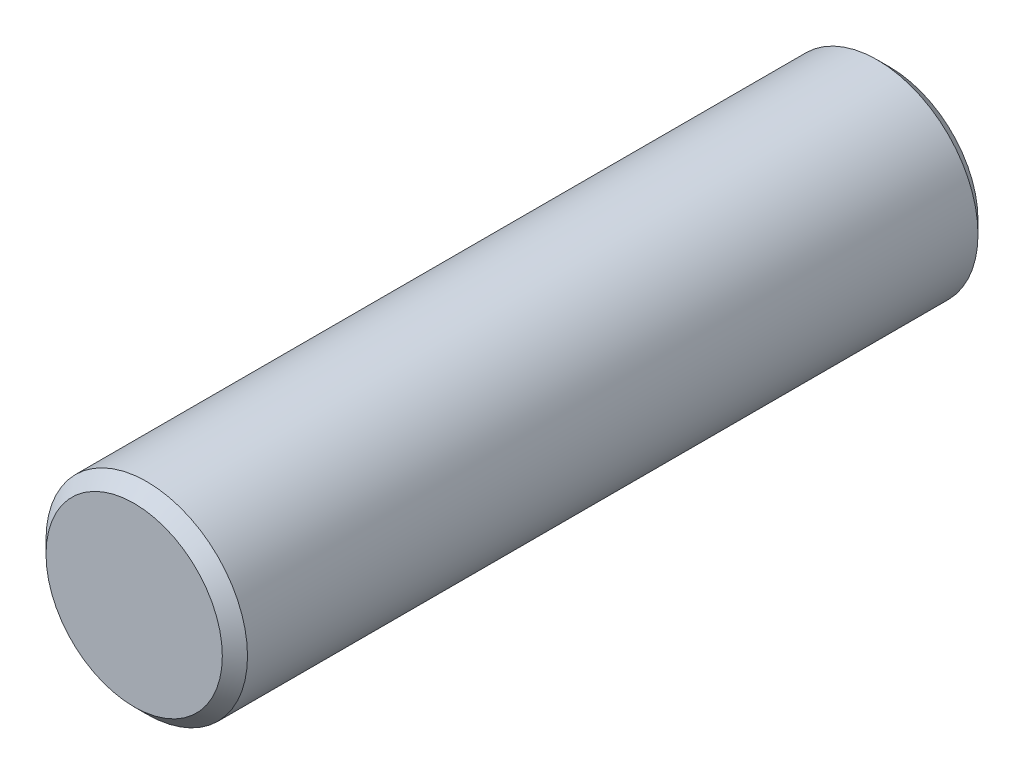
ISO-10303-21;
HEADER;
FILE_DESCRIPTION(('STEP AP214'),'2;1');
FILE_NAME('part.step','',(''),(''),'','','');
FILE_SCHEMA(('AUTOMOTIVE_DESIGN { 1 0 10303 214 1 1 1 1 }'));
ENDSEC;
DATA;
#1=APPLICATION_CONTEXT('core data for automotive mechanical design processes');
#2=APPLICATION_PROTOCOL_DEFINITION('international standard','automotive_design',2000,#1);
#3=PRODUCT_CONTEXT('',#1,'mechanical');
#4=PRODUCT('Part','Part','',(#3));
#5=PRODUCT_RELATED_PRODUCT_CATEGORY('part','',(#4));
#6=PRODUCT_DEFINITION_FORMATION('','',#4);
#7=PRODUCT_DEFINITION_CONTEXT('part definition',#1,'design');
#8=PRODUCT_DEFINITION('design','',#6,#7);
#9=PRODUCT_DEFINITION_SHAPE('','',#8);
#10=(LENGTH_UNIT() NAMED_UNIT(*) SI_UNIT(.MILLI.,.METRE.));
#11=(NAMED_UNIT(*) PLANE_ANGLE_UNIT() SI_UNIT($,.RADIAN.));
#12=(NAMED_UNIT(*) SI_UNIT($,.STERADIAN.) SOLID_ANGLE_UNIT());
#13=UNCERTAINTY_MEASURE_WITH_UNIT(LENGTH_MEASURE(1.E-05),#10,'distance_accuracy_value','');
#14=(GEOMETRIC_REPRESENTATION_CONTEXT(3) GLOBAL_UNCERTAINTY_ASSIGNED_CONTEXT((#13)) GLOBAL_UNIT_ASSIGNED_CONTEXT((#10,
#11,#12)) REPRESENTATION_CONTEXT('',''));
#15=CARTESIAN_POINT('',(0.,0.,0.));
#16=DIRECTION('',(0.,0.,1.));
#17=DIRECTION('',(1.,0.,0.));
#18=AXIS2_PLACEMENT_3D('',#15,#16,#17);
#19=CARTESIAN_POINT('',(0.,0.,30.));
#20=DIRECTION('',(0.,0.,-1.));
#21=DIRECTION('',(-1.,0.,0.));
#22=AXIS2_PLACEMENT_3D('',#19,#20,#21);
#23=CYLINDRICAL_SURFACE('',#22,4.);
#24=CARTESIAN_POINT('',(0.,0.,0.500000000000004));
#25=DIRECTION('',(0.,0.,1.));
#26=DIRECTION('',(1.,0.,0.));
#27=AXIS2_PLACEMENT_3D('',#24,#25,#26);
#28=CIRCLE('',#27,4.);
#29=CARTESIAN_POINT('',(4.,0.,0.500000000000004));
#30=VERTEX_POINT('',#29);
#31=EDGE_CURVE('E42',#30,#30,#28,.T.);
#32=ORIENTED_EDGE('',*,*,#31,.T.);
#33=EDGE_LOOP('',(#32));
#34=FACE_BOUND('',#33,.T.);
#35=CARTESIAN_POINT('',(0.,0.,29.5));
#36=DIRECTION('',(0.,0.,1.));
#37=DIRECTION('',(1.,0.,0.));
#38=AXIS2_PLACEMENT_3D('',#35,#36,#37);
#39=CIRCLE('',#38,4.);
#40=CARTESIAN_POINT('',(4.,0.,29.5));
#41=VERTEX_POINT('',#40);
#42=EDGE_CURVE('E46',#41,#41,#39,.F.);
#43=ORIENTED_EDGE('',*,*,#42,.T.);
#44=EDGE_LOOP('',(#43));
#45=FACE_BOUND('',#44,.T.);
#46=ADVANCED_FACE('F31',(#34,#45),#23,.T.);
#47=CARTESIAN_POINT('',(0.,0.,30.));
#48=DIRECTION('',(0.,0.,1.));
#49=DIRECTION('',(1.,0.,0.));
#50=AXIS2_PLACEMENT_3D('',#47,#48,#49);
#51=PLANE('',#50);
#52=CARTESIAN_POINT('',(0.,0.,30.));
#53=DIRECTION('',(0.,0.,1.));
#54=DIRECTION('',(1.,0.,0.));
#55=AXIS2_PLACEMENT_3D('',#52,#53,#54);
#56=CIRCLE('',#55,3.5);
#57=CARTESIAN_POINT('',(3.5,0.,30.));
#58=VERTEX_POINT('',#57);
#59=EDGE_CURVE('E10',#58,#58,#56,.T.);
#60=ORIENTED_EDGE('',*,*,#59,.T.);
#61=EDGE_LOOP('',(#60));
#62=FACE_BOUND('',#61,.T.);
#63=ADVANCED_FACE('F62',(#62),#51,.T.);
#64=CARTESIAN_POINT('',(0.,0.,0.));
#65=DIRECTION('',(0.,0.,1.));
#66=DIRECTION('',(1.,0.,0.));
#67=AXIS2_PLACEMENT_3D('',#64,#65,#66);
#68=PLANE('',#67);
#69=CARTESIAN_POINT('',(0.,0.,0.));
#70=DIRECTION('',(0.,0.,1.));
#71=DIRECTION('',(1.,0.,0.));
#72=AXIS2_PLACEMENT_3D('',#69,#70,#71);
#73=CIRCLE('',#72,3.49999999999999);
#74=CARTESIAN_POINT('',(3.49999999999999,0.,0.));
#75=VERTEX_POINT('',#74);
#76=EDGE_CURVE('E38',#75,#75,#73,.F.);
#77=ORIENTED_EDGE('',*,*,#76,.T.);
#78=EDGE_LOOP('',(#77));
#79=FACE_BOUND('',#78,.T.);
#80=ADVANCED_FACE('F59',(#79),#68,.F.);
#81=CARTESIAN_POINT('',(0.,0.,0.500000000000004));
#82=DIRECTION('',(0.,0.,1.));
#83=DIRECTION('',(1.,0.,0.));
#84=AXIS2_PLACEMENT_3D('',#81,#82,#83);
#85=CONICAL_SURFACE('',#84,4.,0.785398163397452);
#86=ORIENTED_EDGE('',*,*,#76,.F.);
#87=EDGE_LOOP('',(#86));
#88=FACE_BOUND('',#87,.T.);
#89=ORIENTED_EDGE('',*,*,#31,.F.);
#90=EDGE_LOOP('',(#89));
#91=FACE_BOUND('',#90,.T.);
#92=ADVANCED_FACE('F55',(#88,#91),#85,.T.);
#93=CARTESIAN_POINT('',(0.,0.,30.));
#94=DIRECTION('',(0.,0.,-1.));
#95=DIRECTION('',(-1.,0.,0.));
#96=AXIS2_PLACEMENT_3D('',#93,#94,#95);
#97=CONICAL_SURFACE('',#96,3.5,0.785398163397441);
#98=ORIENTED_EDGE('',*,*,#42,.F.);
#99=EDGE_LOOP('',(#98));
#100=FACE_BOUND('',#99,.T.);
#101=ORIENTED_EDGE('',*,*,#59,.F.);
#102=EDGE_LOOP('',(#101));
#103=FACE_BOUND('',#102,.T.);
#104=ADVANCED_FACE('F33',(#100,#103),#97,.T.);
#105=CLOSED_SHELL('',(#46,#63,#80,#92,#104));
#106=MANIFOLD_SOLID_BREP('B2',#105);
#107=ADVANCED_BREP_SHAPE_REPRESENTATION('',(#18,#106),#14);
#108=SHAPE_DEFINITION_REPRESENTATION(#9,#107);
ENDSEC;
END-ISO-10303-21;
